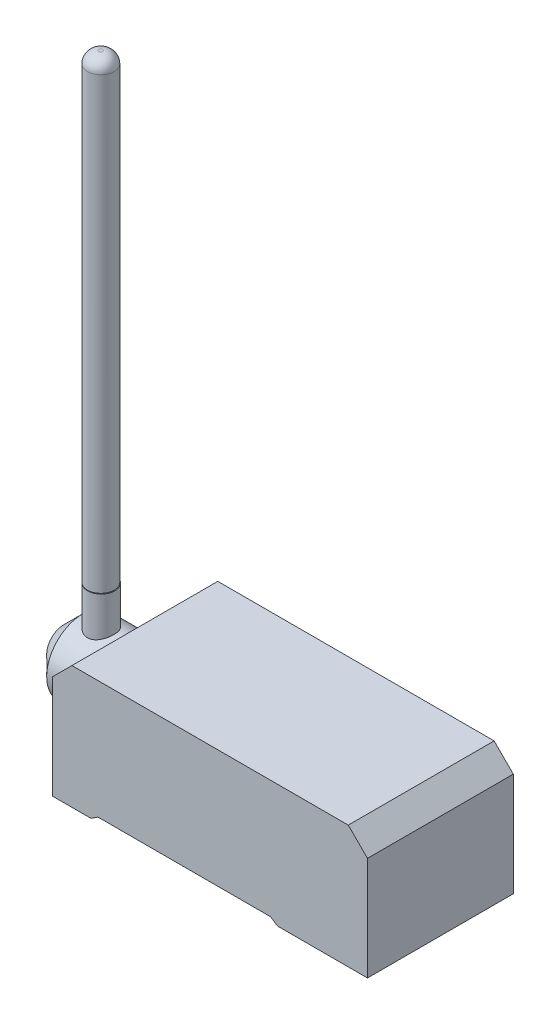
from build123d import *

# Parameters (mm, degrees)
EXTRUSION1_DEPTH = 38
CHANFREIN1_SIZE  = 5
CHANFREIN2_SIZE  = 5
ESQUISSE2_R      = 9.45851297
EXTRUSION2_DEPTH = 20
CHANFREIN3_SIZE  = 5
ESQUISSE3_R      = 3.5
EXTRUSION3_DEPTH = 120
ESQUISSE4_R      = 3.55706623
EXTRUSION4_DEPTH = 20
CONG_1_R         = 3


with BuildPart() as part:
    # Esquisse1 → Extrusion1 (new body)
    with BuildSketch(Plane.XY):
        Polygon((-54.621998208, -12.758422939), (-44.654480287, -12.758422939), (-42.860327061, -11.562320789), (2.139672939, -11.562320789), (3.933826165, -12.758422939), (27.378001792, -12.758422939), (27.378001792, 19.241577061), (-54.621998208, 19.241577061), align=None)
    extrude(amount=EXTRUSION1_DEPTH)

    # Chanfrein1
    chanfrein1_edges = [part.edges().sort_by_distance(p)[0] for p in [
        (-54.621998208, 19.241577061, 19),
    ]]
    chamfer(chanfrein1_edges, length=CHANFREIN1_SIZE)

    # Chanfrein2
    chanfrein2_edges = [part.edges().sort_by_distance(p)[0] for p in [
        (27.378001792, 19.241577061, 19),
    ]]
    chamfer(chanfrein2_edges, length=CHANFREIN2_SIZE)

    # Esquisse2 → Extrusion2 (add)
    with BuildSketch(Plane.ZY.offset(54.621998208)):
        with Locations(Location((15.123175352, 0.057776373, 0), (0, 0, 180))):
            Circle(ESQUISSE2_R)
    extrude(amount=EXTRUSION2_DEPTH)

    # Chanfrein3
    chanfrein3_edges = [part.edges().sort_by_distance(p)[0] for p in [
        (-74.621998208, 0.057776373, 24.581688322),
    ]]
    chamfer(chanfrein3_edges, length=CHANFREIN3_SIZE)



with BuildPart() as body_2:
    # Esquisse3 → Extrusion3 (new body)
    with BuildSketch(Plane(origin=(0, 19.241577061, 0), x_dir=(-1, 0, 0), z_dir=(0, 1, 0))):
        with Locations((64.632685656, 15.465171)):
            Circle(ESQUISSE3_R)
    extrude(amount=EXTRUSION3_DEPTH)


with BuildPart() as part_1:
    add(part.part)

    add(body_2.part)  # Extrusion4 merges body 2
    # Esquisse4 → Extrusion4 (add)
    with BuildSketch(Plane.XZ.offset(-19.241577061)):
        with Locations(Location((-64.440919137, 15.554373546, 0), (0, 0, 186.962689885))):
            Circle(ESQUISSE4_R)
    extrude(amount=EXTRUSION4_DEPTH)

    # Cong_1
    cong_1_edges = [part_1.edges().sort_by_distance(p)[0] for p in [
        (-61.132685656, 139.241577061, 15.465171),
    ]]
    fillet(cong_1_edges, radius=CONG_1_R)


solid = part_1.part
